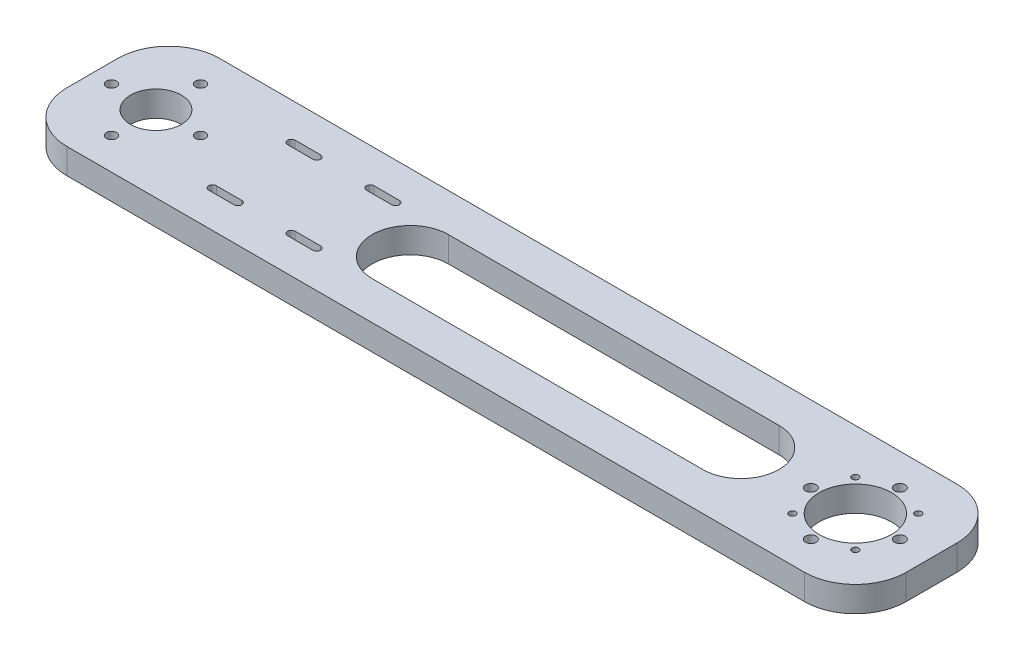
from build123d import *

# Parameters (mm, degrees)
SKETCH_1_W               = 330
SKETCH_1_H               = 60
EXTRUDE_1_DEPTH          = 10
FILLET_1_R               = 20
SKETCH_5_R               = 10
CUT_EXTRUDE_3_DEPTH      = 10
SKETCH_15_R              = 14.25
CUT_EXTRUDE_12_DEPTH     = 169.002976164
SKETCH_18_R              = 1.3
CUT_EXTRUDE_14_DEPTH     = 169.002976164
CUT_EXTRUDE_15_DEPTH     = 169.002976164
SKETCH_20_R              = 2
CUT_EXTRUDE_16_DEPTH     = 10
SKETCH_21_R              = 2.1
CUT_EXTRUDE_17_DEPTH     = 10
CUT_EXTRUDE_18_DEPTH     = 169.002976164
PATTERN_CIRCULAR_1_COUNT = 4


with BuildPart() as part:
    # Sketch 1 → Extrude 1 (new body)
    with BuildSketch(Plane(origin=(0, 0, 0), x_dir=(1, 0, 0), z_dir=(0, 1, 0))):
        Rectangle(SKETCH_1_W, SKETCH_1_H)
    extrude(amount=EXTRUDE_1_DEPTH)

    # Fillet 1
    fillet_1_edges = [part.edges().sort_by_distance(p)[0] for p in [
        (165, 5, 30),
        (-165, 5, 30),
        (-165, 5, -30),
        (165, 5, -30),
    ]]
    fillet(fillet_1_edges, radius=FILLET_1_R)

    # Sketch 5 → Cut-Extrude 3 (cut)
    with BuildSketch(Plane.XZ):
        with Locations(Location((-140, 0, 0), (0, 0, 270))):
            Circle(SKETCH_5_R)
    extrude(amount=-CUT_EXTRUDE_3_DEPTH, mode=Mode.SUBTRACT)

    # Sketch 15 → Cut-Extrude 12 (cut, through all)
    with BuildSketch(Plane.XZ):
        with Locations(Location((135, 0, 0), (0, 0, 270))):
            Circle(SKETCH_15_R)
    extrude(amount=-CUT_EXTRUDE_12_DEPTH, mode=Mode.SUBTRACT)

    # Sketch 18 → Cut-Extrude 14 (cut, through all)
    with BuildSketch(Plane.XZ):
        with Locations(Location((122.625631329, 12.374368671, 0), (0, 0, 270))):
            Circle(SKETCH_18_R)
        with Locations(Location((147.374368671, 12.374368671, 0), (0, 0, 270))):
            Circle(SKETCH_18_R)
        with Locations(Location((147.374368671, -12.374368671, 0), (0, 0, 270))):
            Circle(SKETCH_18_R)
        with Locations(Location((122.625631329, -12.374368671, 0), (0, 0, 270))):
            Circle(SKETCH_18_R)
    extrude(amount=-CUT_EXTRUDE_14_DEPTH, mode=Mode.SUBTRACT)

    # Sketch 19 → Cut-Extrude 15 (cut, through all)
    with BuildSketch(Plane(origin=(0, 0, 0), x_dir=(-1, 0, 0), z_dir=(0, -1, 0))):
        with BuildLine():
            Line((102.26537952, 17), (92.26537952, 17))
            ThreePointArc((92.26537952, 17), (90.76537952, 15.5), (92.26537952, 14))
            Line((92.26537952, 14), (102.26537952, 14))
            ThreePointArc((102.26537952, 14), (103.76537952, 15.5), (102.26537952, 17))
        make_face()
        with BuildLine():
            Line((71.26537952, -17), (61.26537952, -17))
            ThreePointArc((61.26537952, -17), (59.76537952, -15.5), (61.26537952, -14))
            Line((61.26537952, -14), (71.26537952, -14))
            ThreePointArc((71.26537952, -14), (72.76537952, -15.5), (71.26537952, -17))
        make_face()
        with BuildLine():
            Line((71.26537952, 17), (61.26537952, 17))
            ThreePointArc((61.26537952, 17), (59.76537952, 15.5), (61.26537952, 14))
            Line((61.26537952, 14), (71.26537952, 14))
            ThreePointArc((71.26537952, 14), (72.76537952, 15.5), (71.26537952, 17))
        make_face()
        with BuildLine():
            Line((102.26537952, -17), (92.26537952, -17))
            ThreePointArc((92.26537952, -17), (90.76537952, -15.5), (92.26537952, -14))
            Line((92.26537952, -14), (102.26537952, -14))
            ThreePointArc((102.26537952, -14), (103.76537952, -15.5), (102.26537952, -17))
        make_face()
    extrude(amount=-CUT_EXTRUDE_15_DEPTH, mode=Mode.SUBTRACT)

    # Sketch 20 → Cut-Extrude 16 (cut)
    with BuildSketch(Plane(origin=(0, 10, 0), x_dir=(1, 0, 0), z_dir=(0, 1, 0))):
        with Locations(Location((-140, 17.5, 0), (0, 0, 270))):
            Circle(SKETCH_20_R)
    cut_extrude_16 = extrude(amount=-CUT_EXTRUDE_16_DEPTH, mode=Mode.SUBTRACT)

    # Sketch 21 → Cut-Extrude 17 (cut)
    with BuildSketch(Plane.XZ):
        with Locations(Location((135, 17.5, 0), (0, 0, 270))):
            Circle(SKETCH_21_R)
        with Locations(Location((152.5, 0, 0), (0, 0, 270))):
            Circle(SKETCH_21_R)
        with Locations(Location((135, -17.5, 0), (0, 0, 270))):
            Circle(SKETCH_21_R)
        with Locations(Location((117.5, 0, 0), (0, 0, 270))):
            Circle(SKETCH_21_R)
    extrude(amount=-CUT_EXTRUDE_17_DEPTH, mode=Mode.SUBTRACT)

    # Sketch 22 → Cut-Extrude 18 (cut, through all)
    with BuildSketch(Plane(origin=(0, 10, 0), x_dir=(1, 0, 0), z_dir=(0, 1, 0))):
        with BuildLine():
            Line((-40, 15), (90, 15))
            ThreePointArc((90, 15), (105, 0), (90, -15))
            Line((90, -15), (-40, -15))
            ThreePointArc((-40, -15), (-55, 0), (-40, 15))
        make_face()
    extrude(amount=-CUT_EXTRUDE_18_DEPTH, mode=Mode.SUBTRACT)

    # Pattern Circular 1: Cut-Extrude 16 ×4 about axis
    pattern_circular_1_axis = Axis((-140, 0, 0), (0, 1, 0))
    for i in range(1, PATTERN_CIRCULAR_1_COUNT):
        add(cut_extrude_16.rotate(pattern_circular_1_axis, i * 360 / PATTERN_CIRCULAR_1_COUNT), mode=Mode.SUBTRACT)


solid = part.part
